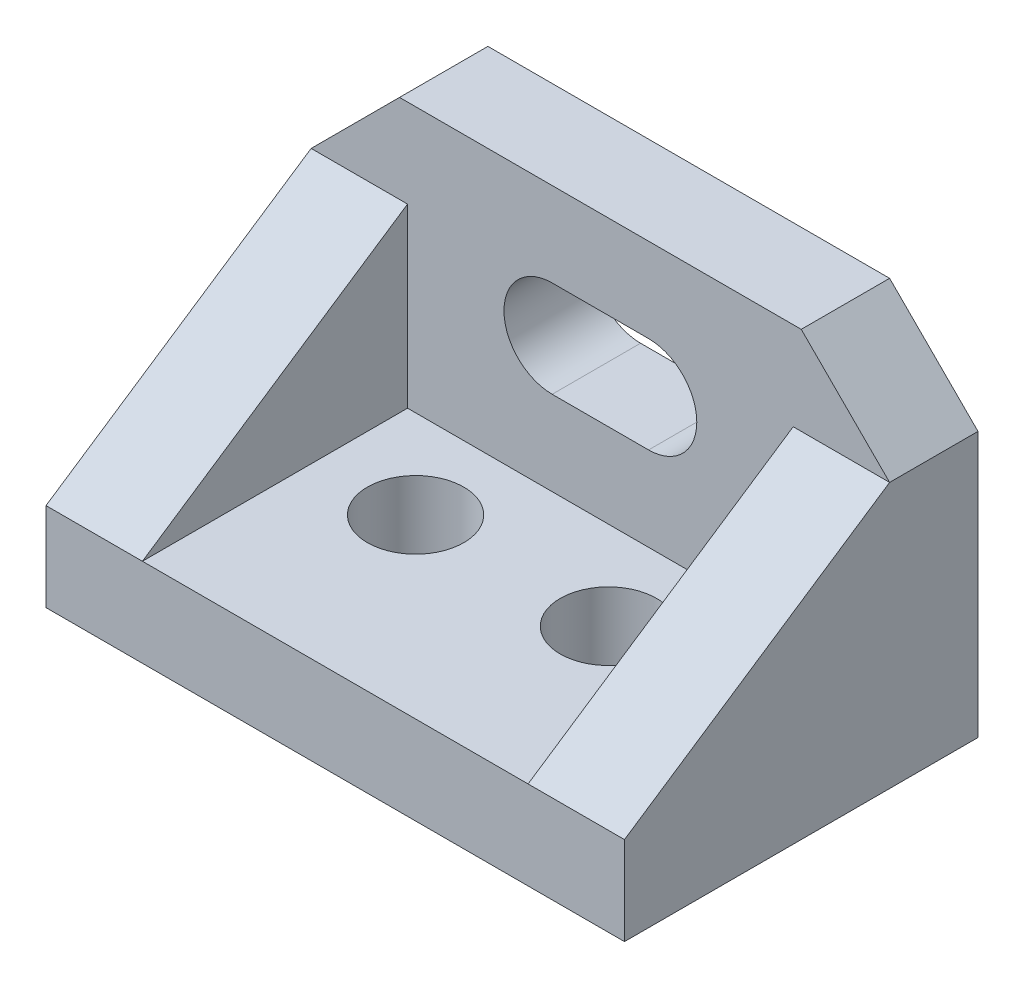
from build123d import *

# Parameters (mm, degrees)
BOSS_EXTRUDE1_DEPTH = 228.6
BOSS_EXTRUDE2_DEPTH = 38.1
BOSS_EXTRUDE3_DEPTH = 38.1
CUT_EXTRUDE1_DEPTH  = 34.925
SKETCH8_R           = 19.05
CUT_EXTRUDE3_DEPTH  = 34.925
CUT_EXTRUDE4_DEPTH  = 34.925


with BuildPart() as part:
    # Sketch1 → Boss-Extrude1 (new body)
    with BuildSketch(Plane(origin=(0, 0, 0), x_dir=(0, 0, -1), z_dir=(1, 0, 0))):
        Polygon((0, 0), (0, 34.925), (104.775, 34.925), (104.775, 139.7), (139.7, 139.7), (139.7, 0), align=None)
    extrude(amount=-BOSS_EXTRUDE1_DEPTH)

    # Sketch4 → Boss-Extrude2 (add)
    with BuildSketch(Plane(origin=(0, 0, 0), x_dir=(0, 0, -1), z_dir=(1, 0, 0))):
        Polygon((0, 34.925), (104.775, 104.775), (104.775, 34.925), align=None)
    extrude(amount=-BOSS_EXTRUDE2_DEPTH)

    # Sketch5 → Boss-Extrude3 (add)
    with BuildSketch(Plane.ZY.offset(228.6)):
        Polygon((-104.775, 104.775), (0, 34.925), (-104.775, 34.925), align=None)
    extrude(amount=-BOSS_EXTRUDE3_DEPTH)

    # Sketch6 → Cut-Extrude1 (cut)
    with BuildSketch(Plane.XY.offset(-104.775)):
        Polygon((-34.925, 139.7), (0, 104.775), (0, 139.7), align=None)
        Polygon((-228.6, 139.7), (-193.675, 139.7), (-228.6, 104.775), align=None)
    extrude(amount=-CUT_EXTRUDE1_DEPTH, mode=Mode.SUBTRACT)

    # Sketch8 → Cut-Extrude3 (cut)
    with BuildSketch(Plane(origin=(0, 34.925, 0), x_dir=(1, 0, 0), z_dir=(0, 1, 0))):
        with Locations(Location((-152.4, 69.85, 0), (0, 0, 270))):
            Circle(SKETCH8_R)
        with Locations(Location((-76.2, 69.85, 0), (0, 0, 270))):
            Circle(SKETCH8_R)
    extrude(amount=-CUT_EXTRUDE3_DEPTH, mode=Mode.SUBTRACT)

    # Sketch11 → Cut-Extrude4 (cut)
    with BuildSketch(Plane.XY.offset(-104.775)):
        with BuildLine():
            Line((-133.35, 106.3625), (-95.25, 106.3625))
            ThreePointArc((-95.25, 106.3625), (-76.2, 87.3125), (-95.25, 68.2625))
            Line((-95.25, 68.2625), (-133.35, 68.2625))
            ThreePointArc((-133.35, 68.2625), (-152.4, 87.3125), (-133.35, 106.3625))
        make_face()
    extrude(amount=-CUT_EXTRUDE4_DEPTH, mode=Mode.SUBTRACT)


solid = part.part
